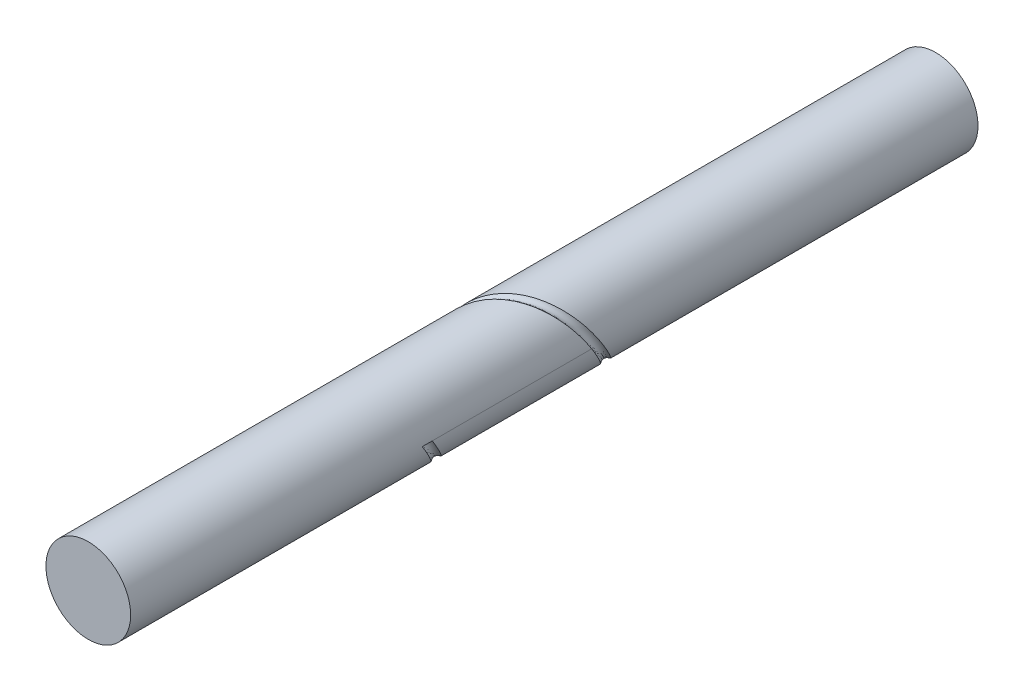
from build123d import *

# Parameters (mm, degrees)
SKETCH1_R              = 25
BOSS_EXTRUDE1_DEPTH    = 500
CUT_SWEEP1_PITCH       = 100
CUT_SWEEP1_HEIGHT      = 150
CUT_SWEEP1_RADIUS      = 27.646
CUT_SWEEP1_START_ANGLE = -180
SKETCH3_R              = 3.969


with BuildPart() as part:
    # Sketch1 → Boss-Extrude1 (new body)
    with BuildSketch(Plane.XY):
        Circle(SKETCH1_R)
    extrude(amount=BOSS_EXTRUDE1_DEPTH)

    # Cut-Sweep1: sweep along a helix
    with BuildLine() as cut_sweep1_path:
        add(Helix(CUT_SWEEP1_PITCH, CUT_SWEEP1_HEIGHT, CUT_SWEEP1_RADIUS, center=(0, 0, 175), direction=(0, 0, 1), mode=Mode.PRIVATE).rotate(Axis((0, 0, 175), (0, 0, 1)), CUT_SWEEP1_START_ANGLE))
    # Sketch3 → Cut-Sweep1 (sweep, cut)
    with BuildSketch(Plane(origin=(0, 0, 0), x_dir=(1, 0, 0), z_dir=(0, 1, 0))):
        with Locations((-27.646, -175)):
            Circle(SKETCH3_R)
    sweep(path=cut_sweep1_path.line, is_frenet=True, mode=Mode.SUBTRACT)


solid = part.part
